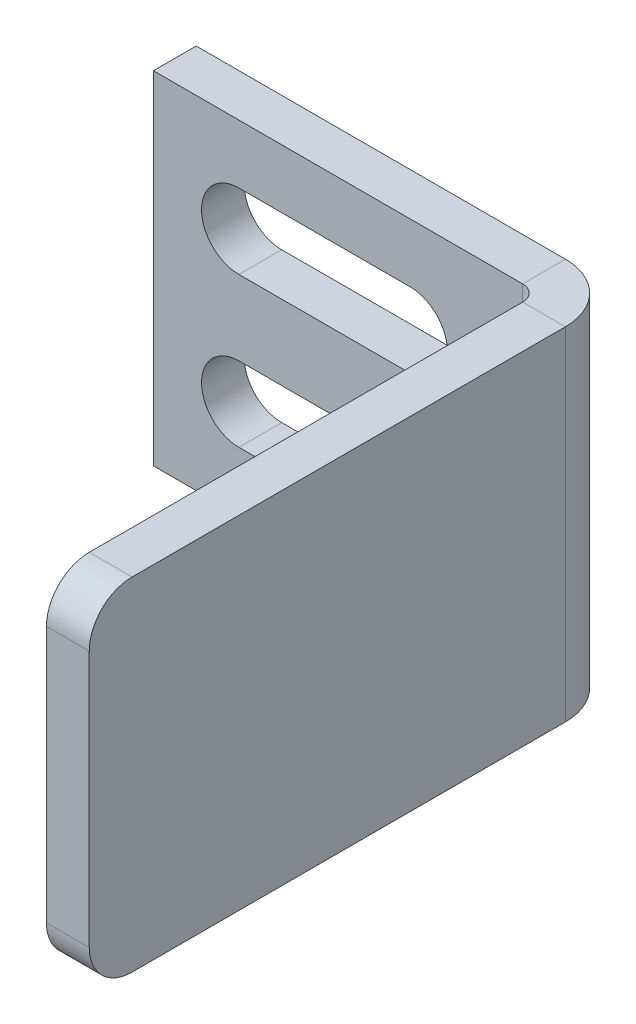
ISO-10303-21;
HEADER;
FILE_DESCRIPTION(('STEP AP214'),'2;1');
FILE_NAME('part.step','',(''),(''),'','','');
FILE_SCHEMA(('AUTOMOTIVE_DESIGN { 1 0 10303 214 1 1 1 1 }'));
ENDSEC;
DATA;
#1=APPLICATION_CONTEXT('core data for automotive mechanical design processes');
#2=APPLICATION_PROTOCOL_DEFINITION('international standard','automotive_design',2000,#1);
#3=PRODUCT_CONTEXT('',#1,'mechanical');
#4=PRODUCT('Part','Part','',(#3));
#5=PRODUCT_RELATED_PRODUCT_CATEGORY('part','',(#4));
#6=PRODUCT_DEFINITION_FORMATION('','',#4);
#7=PRODUCT_DEFINITION_CONTEXT('part definition',#1,'design');
#8=PRODUCT_DEFINITION('design','',#6,#7);
#9=PRODUCT_DEFINITION_SHAPE('','',#8);
#10=(LENGTH_UNIT() NAMED_UNIT(*) SI_UNIT(.MILLI.,.METRE.));
#11=(NAMED_UNIT(*) PLANE_ANGLE_UNIT() SI_UNIT($,.RADIAN.));
#12=(NAMED_UNIT(*) SI_UNIT($,.STERADIAN.) SOLID_ANGLE_UNIT());
#13=UNCERTAINTY_MEASURE_WITH_UNIT(LENGTH_MEASURE(1.E-05),#10,'distance_accuracy_value','');
#14=(GEOMETRIC_REPRESENTATION_CONTEXT(3) GLOBAL_UNCERTAINTY_ASSIGNED_CONTEXT((#13)) GLOBAL_UNIT_ASSIGNED_CONTEXT((#10,
#11,#12)) REPRESENTATION_CONTEXT('',''));
#15=CARTESIAN_POINT('',(0.,0.,0.));
#16=DIRECTION('',(0.,0.,1.));
#17=DIRECTION('',(1.,0.,0.));
#18=AXIS2_PLACEMENT_3D('',#15,#16,#17);
#19=CARTESIAN_POINT('',(4.23272528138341E-13,4.00724302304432,2.));
#20=DIRECTION('',(0.,-1.,0.));
#21=DIRECTION('',(1.,0.,0.));
#22=AXIS2_PLACEMENT_3D('',#19,#20,#21);
#23=PLANE('',#22);
#24=DIRECTION('',(0.,0.,-1.));
#25=VECTOR('',#24,1.);
#26=CARTESIAN_POINT('',(-2.73659999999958,4.00724302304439,2.));
#27=LINE('',#26,#25);
#28=CARTESIAN_POINT('',(-2.73659999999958,4.00724302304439,2.));
#29=VERTEX_POINT('',#28);
#30=CARTESIAN_POINT('',(-2.73659999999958,4.00724302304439,0.));
#31=VERTEX_POINT('',#30);
#32=EDGE_CURVE('E249',#29,#31,#27,.T.);
#33=ORIENTED_EDGE('',*,*,#32,.T.);
#34=DIRECTION('',(-1.,0.,0.));
#35=VECTOR('',#34,1.);
#36=CARTESIAN_POINT('',(4.23272528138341E-13,4.00724302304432,0.));
#37=LINE('',#36,#35);
#38=CARTESIAN_POINT('',(-19.9999999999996,4.00724302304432,0.));
#39=VERTEX_POINT('',#38);
#40=EDGE_CURVE('E262',#31,#39,#37,.T.);
#41=ORIENTED_EDGE('',*,*,#40,.T.);
#42=DIRECTION('',(0.,0.,-1.));
#43=VECTOR('',#42,1.);
#44=CARTESIAN_POINT('',(-19.9999999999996,4.00724302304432,2.));
#45=LINE('',#44,#43);
#46=CARTESIAN_POINT('',(-19.9999999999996,4.00724302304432,2.));
#47=VERTEX_POINT('',#46);
#48=EDGE_CURVE('E281',#47,#39,#45,.T.);
#49=ORIENTED_EDGE('',*,*,#48,.F.);
#50=DIRECTION('',(-1.,0.,0.));
#51=VECTOR('',#50,1.);
#52=CARTESIAN_POINT('',(4.23272528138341E-13,4.00724302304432,2.));
#53=LINE('',#52,#51);
#54=EDGE_CURVE('E265',#29,#47,#53,.T.);
#55=ORIENTED_EDGE('',*,*,#54,.F.);
#56=EDGE_LOOP('',(#33,#41,#49,#55));
#57=FACE_BOUND('',#56,.T.);
#58=ADVANCED_FACE('F16',(#57),#23,.F.);
#59=CARTESIAN_POINT('',(0.,-11.9927569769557,2.));
#60=DIRECTION('',(0.,1.,0.));
#61=DIRECTION('',(-1.,0.,0.));
#62=AXIS2_PLACEMENT_3D('',#59,#60,#61);
#63=PLANE('',#62);
#64=DIRECTION('',(0.,0.,-1.));
#65=VECTOR('',#64,1.);
#66=CARTESIAN_POINT('',(-2.7366,-11.9927569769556,2.));
#67=LINE('',#66,#65);
#68=CARTESIAN_POINT('',(-2.7366,-11.9927569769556,2.));
#69=VERTEX_POINT('',#68);
#70=CARTESIAN_POINT('',(-2.7366,-11.9927569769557,0.));
#71=VERTEX_POINT('',#70);
#72=EDGE_CURVE('E259',#69,#71,#67,.T.);
#73=ORIENTED_EDGE('',*,*,#72,.F.);
#74=DIRECTION('',(1.,0.,0.));
#75=VECTOR('',#74,1.);
#76=CARTESIAN_POINT('',(0.,-11.9927569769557,2.));
#77=LINE('',#76,#75);
#78=CARTESIAN_POINT('',(-19.9999999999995,-11.9927569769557,2.));
#79=VERTEX_POINT('',#78);
#80=EDGE_CURVE('E270',#79,#69,#77,.T.);
#81=ORIENTED_EDGE('',*,*,#80,.F.);
#82=DIRECTION('',(0.,0.,-1.));
#83=VECTOR('',#82,1.);
#84=CARTESIAN_POINT('',(-19.9999999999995,-11.9927569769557,2.));
#85=LINE('',#84,#83);
#86=CARTESIAN_POINT('',(-19.9999999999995,-11.9927569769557,0.));
#87=VERTEX_POINT('',#86);
#88=EDGE_CURVE('E273',#79,#87,#85,.T.);
#89=ORIENTED_EDGE('',*,*,#88,.T.);
#90=DIRECTION('',(1.,0.,0.));
#91=VECTOR('',#90,1.);
#92=CARTESIAN_POINT('',(0.,-11.9927569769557,0.));
#93=LINE('',#92,#91);
#94=EDGE_CURVE('E268',#87,#71,#93,.T.);
#95=ORIENTED_EDGE('',*,*,#94,.T.);
#96=EDGE_LOOP('',(#73,#81,#89,#95));
#97=FACE_BOUND('',#96,.T.);
#98=ADVANCED_FACE('F334',(#97),#63,.F.);
#99=CARTESIAN_POINT('',(0.,0.,2.));
#100=DIRECTION('',(0.,0.,-1.));
#101=DIRECTION('',(-1.,0.,0.));
#102=AXIS2_PLACEMENT_3D('',#99,#100,#101);
#103=PLANE('',#102);
#104=DIRECTION('',(1.,0.,0.));
#105=VECTOR('',#104,1.);
#106=CARTESIAN_POINT('',(-15.9999999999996,-2.24275697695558,2.));
#107=LINE('',#106,#105);
#108=CARTESIAN_POINT('',(-15.9999999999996,-2.24275697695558,2.));
#109=VERTEX_POINT('',#108);
#110=CARTESIAN_POINT('',(-7.99999999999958,-2.24275697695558,2.));
#111=VERTEX_POINT('',#110);
#112=EDGE_CURVE('E177',#109,#111,#107,.T.);
#113=ORIENTED_EDGE('',*,*,#112,.F.);
#114=CARTESIAN_POINT('',(-15.9999999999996,-0.492756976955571,2.));
#115=DIRECTION('',(0.,0.,1.));
#116=DIRECTION('',(-1.,0.,0.));
#117=AXIS2_PLACEMENT_3D('',#114,#115,#116);
#118=CIRCLE('',#117,1.75);
#119=CARTESIAN_POINT('',(-15.9999999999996,1.25724302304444,2.));
#120=VERTEX_POINT('',#119);
#121=EDGE_CURVE('E150',#120,#109,#118,.T.);
#122=ORIENTED_EDGE('',*,*,#121,.F.);
#123=DIRECTION('',(-1.,0.,0.));
#124=VECTOR('',#123,1.);
#125=CARTESIAN_POINT('',(-15.9999999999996,1.25724302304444,2.));
#126=LINE('',#125,#124);
#127=CARTESIAN_POINT('',(-7.99999999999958,1.25724302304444,2.));
#128=VERTEX_POINT('',#127);
#129=EDGE_CURVE('E168',#128,#120,#126,.T.);
#130=ORIENTED_EDGE('',*,*,#129,.F.);
#131=CARTESIAN_POINT('',(-7.99999999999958,-0.49275697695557,2.));
#132=DIRECTION('',(0.,0.,1.));
#133=DIRECTION('',(-1.,0.,0.));
#134=AXIS2_PLACEMENT_3D('',#131,#132,#133);
#135=CIRCLE('',#134,1.75);
#136=EDGE_CURVE('E171',#111,#128,#135,.T.);
#137=ORIENTED_EDGE('',*,*,#136,.F.);
#138=EDGE_LOOP('',(#113,#122,#130,#137));
#139=FACE_BOUND('',#138,.T.);
#140=DIRECTION('',(1.,0.,0.));
#141=VECTOR('',#140,1.);
#142=CARTESIAN_POINT('',(-15.9999999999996,-9.24275697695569,2.));
#143=LINE('',#142,#141);
#144=CARTESIAN_POINT('',(-15.9999999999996,-9.24275697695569,2.));
#145=VERTEX_POINT('',#144);
#146=CARTESIAN_POINT('',(-7.99999999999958,-9.24275697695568,2.));
#147=VERTEX_POINT('',#146);
#148=EDGE_CURVE('E202',#145,#147,#143,.T.);
#149=ORIENTED_EDGE('',*,*,#148,.F.);
#150=CARTESIAN_POINT('',(-15.9999999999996,-7.49275697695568,2.));
#151=DIRECTION('',(0.,0.,1.));
#152=DIRECTION('',(1.,0.,0.));
#153=AXIS2_PLACEMENT_3D('',#150,#151,#152);
#154=CIRCLE('',#153,1.75);
#155=CARTESIAN_POINT('',(-15.9999999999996,-5.74275697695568,2.));
#156=VERTEX_POINT('',#155);
#157=EDGE_CURVE('E183',#156,#145,#154,.T.);
#158=ORIENTED_EDGE('',*,*,#157,.F.);
#159=DIRECTION('',(-1.,0.,0.));
#160=VECTOR('',#159,1.);
#161=CARTESIAN_POINT('',(-15.9999999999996,-5.74275697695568,2.));
#162=LINE('',#161,#160);
#163=CARTESIAN_POINT('',(-7.99999999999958,-5.74275697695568,2.));
#164=VERTEX_POINT('',#163);
#165=EDGE_CURVE('E191',#164,#156,#162,.T.);
#166=ORIENTED_EDGE('',*,*,#165,.F.);
#167=CARTESIAN_POINT('',(-7.99999999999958,-7.49275697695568,2.));
#168=DIRECTION('',(0.,0.,1.));
#169=DIRECTION('',(1.,0.,0.));
#170=AXIS2_PLACEMENT_3D('',#167,#168,#169);
#171=CIRCLE('',#170,1.75);
#172=EDGE_CURVE('E205',#147,#164,#171,.T.);
#173=ORIENTED_EDGE('',*,*,#172,.F.);
#174=EDGE_LOOP('',(#149,#158,#166,#173));
#175=FACE_BOUND('',#174,.T.);
#176=DIRECTION('',(0.,1.,0.));
#177=VECTOR('',#176,1.);
#178=CARTESIAN_POINT('',(-2.73659999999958,4.00724302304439,2.));
#179=LINE('',#178,#177);
#180=EDGE_CURVE('E255',#29,#69,#179,.F.);
#181=ORIENTED_EDGE('',*,*,#180,.F.);
#182=ORIENTED_EDGE('',*,*,#54,.T.);
#183=DIRECTION('',(0.,-1.,0.));
#184=VECTOR('',#183,1.);
#185=CARTESIAN_POINT('',(-19.9999999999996,4.00724302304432,2.));
#186=LINE('',#185,#184);
#187=EDGE_CURVE('E267',#47,#79,#186,.T.);
#188=ORIENTED_EDGE('',*,*,#187,.T.);
#189=ORIENTED_EDGE('',*,*,#80,.T.);
#190=EDGE_LOOP('',(#181,#182,#188,#189));
#191=FACE_BOUND('',#190,.T.);
#192=ADVANCED_FACE('F346',(#139,#175,#191),#103,.F.);
#193=CARTESIAN_POINT('',(0.,0.,0.));
#194=DIRECTION('',(0.,0.,-1.));
#195=DIRECTION('',(-1.,0.,0.));
#196=AXIS2_PLACEMENT_3D('',#193,#194,#195);
#197=PLANE('',#196);
#198=CARTESIAN_POINT('',(-15.9999999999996,-0.492756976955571,0.));
#199=DIRECTION('',(0.,0.,1.));
#200=DIRECTION('',(-1.,0.,0.));
#201=AXIS2_PLACEMENT_3D('',#198,#199,#200);
#202=CIRCLE('',#201,1.75);
#203=CARTESIAN_POINT('',(-15.9999999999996,1.25724302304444,0.));
#204=VERTEX_POINT('',#203);
#205=CARTESIAN_POINT('',(-15.9999999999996,-2.24275697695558,0.));
#206=VERTEX_POINT('',#205);
#207=EDGE_CURVE('E147',#204,#206,#202,.T.);
#208=ORIENTED_EDGE('',*,*,#207,.T.);
#209=DIRECTION('',(1.,0.,0.));
#210=VECTOR('',#209,1.);
#211=CARTESIAN_POINT('',(-15.9999999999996,-2.24275697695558,0.));
#212=LINE('',#211,#210);
#213=CARTESIAN_POINT('',(-7.99999999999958,-2.24275697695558,0.));
#214=VERTEX_POINT('',#213);
#215=EDGE_CURVE('E159',#206,#214,#212,.T.);
#216=ORIENTED_EDGE('',*,*,#215,.T.);
#217=CARTESIAN_POINT('',(-7.99999999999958,-0.49275697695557,0.));
#218=DIRECTION('',(0.,0.,1.));
#219=DIRECTION('',(-1.,0.,0.));
#220=AXIS2_PLACEMENT_3D('',#217,#218,#219);
#221=CIRCLE('',#220,1.75);
#222=CARTESIAN_POINT('',(-7.99999999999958,1.25724302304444,0.));
#223=VERTEX_POINT('',#222);
#224=EDGE_CURVE('E163',#214,#223,#221,.T.);
#225=ORIENTED_EDGE('',*,*,#224,.T.);
#226=DIRECTION('',(-1.,0.,0.));
#227=VECTOR('',#226,1.);
#228=CARTESIAN_POINT('',(-15.9999999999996,1.25724302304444,0.));
#229=LINE('',#228,#227);
#230=EDGE_CURVE('E155',#223,#204,#229,.T.);
#231=ORIENTED_EDGE('',*,*,#230,.T.);
#232=EDGE_LOOP('',(#208,#216,#225,#231));
#233=FACE_BOUND('',#232,.T.);
#234=CARTESIAN_POINT('',(-15.9999999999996,-7.49275697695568,0.));
#235=DIRECTION('',(0.,0.,1.));
#236=DIRECTION('',(1.,0.,0.));
#237=AXIS2_PLACEMENT_3D('',#234,#235,#236);
#238=CIRCLE('',#237,1.75);
#239=CARTESIAN_POINT('',(-15.9999999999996,-5.74275697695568,0.));
#240=VERTEX_POINT('',#239);
#241=CARTESIAN_POINT('',(-15.9999999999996,-9.24275697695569,0.));
#242=VERTEX_POINT('',#241);
#243=EDGE_CURVE('E187',#240,#242,#238,.T.);
#244=ORIENTED_EDGE('',*,*,#243,.T.);
#245=DIRECTION('',(1.,0.,0.));
#246=VECTOR('',#245,1.);
#247=CARTESIAN_POINT('',(-15.9999999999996,-9.24275697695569,0.));
#248=LINE('',#247,#246);
#249=CARTESIAN_POINT('',(-7.99999999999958,-9.24275697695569,0.));
#250=VERTEX_POINT('',#249);
#251=EDGE_CURVE('E190',#242,#250,#248,.T.);
#252=ORIENTED_EDGE('',*,*,#251,.T.);
#253=CARTESIAN_POINT('',(-7.99999999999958,-7.49275697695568,0.));
#254=DIRECTION('',(0.,0.,1.));
#255=DIRECTION('',(1.,0.,0.));
#256=AXIS2_PLACEMENT_3D('',#253,#254,#255);
#257=CIRCLE('',#256,1.75);
#258=CARTESIAN_POINT('',(-7.99999999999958,-5.74275697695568,0.));
#259=VERTEX_POINT('',#258);
#260=EDGE_CURVE('E194',#250,#259,#257,.T.);
#261=ORIENTED_EDGE('',*,*,#260,.T.);
#262=DIRECTION('',(-1.,0.,0.));
#263=VECTOR('',#262,1.);
#264=CARTESIAN_POINT('',(-15.9999999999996,-5.74275697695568,0.));
#265=LINE('',#264,#263);
#266=EDGE_CURVE('E197',#259,#240,#265,.T.);
#267=ORIENTED_EDGE('',*,*,#266,.T.);
#268=EDGE_LOOP('',(#244,#252,#261,#267));
#269=FACE_BOUND('',#268,.T.);
#270=ORIENTED_EDGE('',*,*,#40,.F.);
#271=DIRECTION('',(0.,1.,0.));
#272=VECTOR('',#271,1.);
#273=CARTESIAN_POINT('',(-2.73659999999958,4.00724302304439,0.));
#274=LINE('',#273,#272);
#275=EDGE_CURVE('E242',#31,#71,#274,.F.);
#276=ORIENTED_EDGE('',*,*,#275,.T.);
#277=ORIENTED_EDGE('',*,*,#94,.F.);
#278=DIRECTION('',(0.,-1.,0.));
#279=VECTOR('',#278,1.);
#280=CARTESIAN_POINT('',(-19.9999999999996,4.00724302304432,0.));
#281=LINE('',#280,#279);
#282=EDGE_CURVE('E275',#39,#87,#281,.T.);
#283=ORIENTED_EDGE('',*,*,#282,.F.);
#284=EDGE_LOOP('',(#270,#276,#277,#283));
#285=FACE_BOUND('',#284,.T.);
#286=ADVANCED_FACE('F165',(#233,#269,#285),#197,.T.);
#287=CARTESIAN_POINT('',(-19.9999999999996,4.00724302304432,2.));
#288=DIRECTION('',(1.,0.,0.));
#289=DIRECTION('',(0.,1.,0.));
#290=AXIS2_PLACEMENT_3D('',#287,#288,#289);
#291=PLANE('',#290);
#292=ORIENTED_EDGE('',*,*,#282,.T.);
#293=ORIENTED_EDGE('',*,*,#88,.F.);
#294=ORIENTED_EDGE('',*,*,#187,.F.);
#295=ORIENTED_EDGE('',*,*,#48,.T.);
#296=EDGE_LOOP('',(#292,#293,#294,#295));
#297=FACE_BOUND('',#296,.T.);
#298=ADVANCED_FACE('F338',(#297),#291,.F.);
#299=CARTESIAN_POINT('',(-2.7366,-11.9927569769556,2.7366));
#300=DIRECTION('',(0.,-1.,0.));
#301=DIRECTION('',(1.,0.,0.));
#302=AXIS2_PLACEMENT_3D('',#299,#300,#301);
#303=PLANE('',#302);
#304=DIRECTION('',(-1.,0.,0.));
#305=VECTOR('',#304,1.);
#306=CARTESIAN_POINT('',(0.,-11.9927569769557,2.7366));
#307=LINE('',#306,#305);
#308=CARTESIAN_POINT('',(-2.,-11.9927569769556,2.7366));
#309=VERTEX_POINT('',#308);
#310=CARTESIAN_POINT('',(0.,-11.9927569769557,2.7366));
#311=VERTEX_POINT('',#310);
#312=EDGE_CURVE('E212',#309,#311,#307,.F.);
#313=ORIENTED_EDGE('',*,*,#312,.F.);
#314=CARTESIAN_POINT('',(-2.7366,-11.9927569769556,2.7366));
#315=DIRECTION('',(0.,1.,0.));
#316=DIRECTION('',(-1.,0.,0.));
#317=AXIS2_PLACEMENT_3D('',#314,#315,#316);
#318=CIRCLE('',#317,0.7366);
#319=EDGE_CURVE('E252',#69,#309,#318,.F.);
#320=ORIENTED_EDGE('',*,*,#319,.F.);
#321=ORIENTED_EDGE('',*,*,#72,.T.);
#322=CARTESIAN_POINT('',(-2.7366,-11.9927569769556,2.7366));
#323=DIRECTION('',(0.,1.,0.));
#324=DIRECTION('',(-1.,0.,0.));
#325=AXIS2_PLACEMENT_3D('',#322,#323,#324);
#326=CIRCLE('',#325,2.7366);
#327=EDGE_CURVE('E245',#71,#311,#326,.F.);
#328=ORIENTED_EDGE('',*,*,#327,.T.);
#329=EDGE_LOOP('',(#313,#320,#321,#328));
#330=FACE_BOUND('',#329,.T.);
#331=ADVANCED_FACE('F325',(#330),#303,.T.);
#332=CARTESIAN_POINT('',(-2.73659999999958,4.00724302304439,2.7366));
#333=DIRECTION('',(0.,-1.,0.));
#334=DIRECTION('',(1.,0.,0.));
#335=AXIS2_PLACEMENT_3D('',#332,#333,#334);
#336=PLANE('',#335);
#337=CARTESIAN_POINT('',(-2.73659999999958,4.00724302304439,2.7366));
#338=DIRECTION('',(0.,1.,0.));
#339=DIRECTION('',(-1.,0.,0.));
#340=AXIS2_PLACEMENT_3D('',#337,#338,#339);
#341=CIRCLE('',#340,0.7366);
#342=CARTESIAN_POINT('',(-1.99999999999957,4.00724302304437,2.7366));
#343=VERTEX_POINT('',#342);
#344=EDGE_CURVE('E221',#343,#29,#341,.T.);
#345=ORIENTED_EDGE('',*,*,#344,.F.);
#346=DIRECTION('',(-1.,0.,0.));
#347=VECTOR('',#346,1.);
#348=CARTESIAN_POINT('',(-1.99999999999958,4.00724302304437,2.7366));
#349=LINE('',#348,#347);
#350=CARTESIAN_POINT('',(4.26001033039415E-13,4.00724302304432,2.7366));
#351=VERTEX_POINT('',#350);
#352=EDGE_CURVE('E235',#343,#351,#349,.F.);
#353=ORIENTED_EDGE('',*,*,#352,.T.);
#354=CARTESIAN_POINT('',(-2.73659999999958,4.00724302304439,2.7366));
#355=DIRECTION('',(0.,1.,0.));
#356=DIRECTION('',(-1.,0.,0.));
#357=AXIS2_PLACEMENT_3D('',#354,#355,#356);
#358=CIRCLE('',#357,2.7366);
#359=EDGE_CURVE('E246',#351,#31,#358,.T.);
#360=ORIENTED_EDGE('',*,*,#359,.T.);
#361=ORIENTED_EDGE('',*,*,#32,.F.);
#362=EDGE_LOOP('',(#345,#353,#360,#361));
#363=FACE_BOUND('',#362,.T.);
#364=ADVANCED_FACE('F321',(#363),#336,.F.);
#365=CARTESIAN_POINT('',(-2.73659999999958,4.00724302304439,2.7366));
#366=DIRECTION('',(0.,1.,0.));
#367=DIRECTION('',(1.,0.,0.));
#368=AXIS2_PLACEMENT_3D('',#365,#366,#367);
#369=CYLINDRICAL_SURFACE('',#368,2.7366);
#370=ORIENTED_EDGE('',*,*,#275,.F.);
#371=ORIENTED_EDGE('',*,*,#359,.F.);
#372=DIRECTION('',(0.,1.,0.));
#373=VECTOR('',#372,1.);
#374=CARTESIAN_POINT('',(0.,-11.9927569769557,2.7366));
#375=LINE('',#374,#373);
#376=EDGE_CURVE('E232',#351,#311,#375,.F.);
#377=ORIENTED_EDGE('',*,*,#376,.T.);
#378=ORIENTED_EDGE('',*,*,#327,.F.);
#379=EDGE_LOOP('',(#370,#371,#377,#378));
#380=FACE_BOUND('',#379,.T.);
#381=ADVANCED_FACE('F323',(#380),#369,.T.);
#382=CARTESIAN_POINT('',(-2.73659999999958,4.00724302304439,2.7366));
#383=DIRECTION('',(0.,1.,0.));
#384=DIRECTION('',(1.,0.,0.));
#385=AXIS2_PLACEMENT_3D('',#382,#383,#384);
#386=CYLINDRICAL_SURFACE('',#385,0.7366);
#387=ORIENTED_EDGE('',*,*,#180,.T.);
#388=ORIENTED_EDGE('',*,*,#319,.T.);
#389=DIRECTION('',(0.,1.,0.));
#390=VECTOR('',#389,1.);
#391=CARTESIAN_POINT('',(-2.,-11.9927569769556,2.7366));
#392=LINE('',#391,#390);
#393=EDGE_CURVE('E238',#309,#343,#392,.T.);
#394=ORIENTED_EDGE('',*,*,#393,.T.);
#395=ORIENTED_EDGE('',*,*,#344,.T.);
#396=EDGE_LOOP('',(#387,#388,#394,#395));
#397=FACE_BOUND('',#396,.T.);
#398=ADVANCED_FACE('F344',(#397),#386,.F.);
#399=CARTESIAN_POINT('',(5.03503488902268E-13,4.00724302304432,25.));
#400=DIRECTION('',(0.,-1.,0.));
#401=DIRECTION('',(1.,0.,0.));
#402=AXIS2_PLACEMENT_3D('',#399,#400,#401);
#403=PLANE('',#402);
#404=DIRECTION('',(0.,0.,-1.));
#405=VECTOR('',#404,1.);
#406=CARTESIAN_POINT('',(-1.9999999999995,4.00724302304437,25.));
#407=LINE('',#406,#405);
#408=CARTESIAN_POINT('',(-1.99999999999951,4.00724302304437,23.));
#409=VERTEX_POINT('',#408);
#410=EDGE_CURVE('E230',#343,#409,#407,.F.);
#411=ORIENTED_EDGE('',*,*,#410,.T.);
#412=DIRECTION('',(-1.,0.,0.));
#413=VECTOR('',#412,1.);
#414=CARTESIAN_POINT('',(4.96520526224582E-13,4.00724302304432,23.));
#415=LINE('',#414,#413);
#416=CARTESIAN_POINT('',(4.96772250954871E-13,4.00724302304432,23.));
#417=VERTEX_POINT('',#416);
#418=EDGE_CURVE('E11',#409,#417,#415,.F.);
#419=ORIENTED_EDGE('',*,*,#418,.T.);
#420=DIRECTION('',(0.,0.,1.));
#421=VECTOR('',#420,1.);
#422=CARTESIAN_POINT('',(4.16468180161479E-13,4.00724302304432,0.));
#423=LINE('',#422,#421);
#424=EDGE_CURVE('E224',#351,#417,#423,.T.);
#425=ORIENTED_EDGE('',*,*,#424,.F.);
#426=ORIENTED_EDGE('',*,*,#352,.F.);
#427=EDGE_LOOP('',(#411,#419,#425,#426));
#428=FACE_BOUND('',#427,.T.);
#429=ADVANCED_FACE('F318',(#428),#403,.F.);
#430=CARTESIAN_POINT('',(0.,-11.9927569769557,2.));
#431=DIRECTION('',(0.,1.,0.));
#432=DIRECTION('',(-1.,0.,0.));
#433=AXIS2_PLACEMENT_3D('',#430,#431,#432);
#434=PLANE('',#433);
#435=DIRECTION('',(0.,0.,-1.));
#436=VECTOR('',#435,1.);
#437=CARTESIAN_POINT('',(0.,-11.9927569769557,0.));
#438=LINE('',#437,#436);
#439=CARTESIAN_POINT('',(0.,-11.9927569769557,23.));
#440=VERTEX_POINT('',#439);
#441=EDGE_CURVE('E219',#440,#311,#438,.T.);
#442=ORIENTED_EDGE('',*,*,#441,.F.);
#443=DIRECTION('',(-1.,0.,0.));
#444=VECTOR('',#443,1.);
#445=CARTESIAN_POINT('',(0.,-11.9927569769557,23.));
#446=LINE('',#445,#444);
#447=CARTESIAN_POINT('',(-1.99999999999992,-11.9927569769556,23.));
#448=VERTEX_POINT('',#447);
#449=EDGE_CURVE('E284',#440,#448,#446,.T.);
#450=ORIENTED_EDGE('',*,*,#449,.T.);
#451=DIRECTION('',(0.,0.,1.));
#452=VECTOR('',#451,1.);
#453=CARTESIAN_POINT('',(-2.,-11.9927569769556,2.));
#454=LINE('',#453,#452);
#455=EDGE_CURVE('E226',#448,#309,#454,.F.);
#456=ORIENTED_EDGE('',*,*,#455,.T.);
#457=ORIENTED_EDGE('',*,*,#312,.T.);
#458=EDGE_LOOP('',(#442,#450,#456,#457));
#459=FACE_BOUND('',#458,.T.);
#460=ADVANCED_FACE('F304',(#459),#434,.F.);
#461=CARTESIAN_POINT('',(3.10949183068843E-13,0.,0.));
#462=DIRECTION('',(-1.,0.,0.));
#463=DIRECTION('',(0.,-1.,0.));
#464=AXIS2_PLACEMENT_3D('',#461,#462,#463);
#465=PLANE('',#464);
#466=DIRECTION('',(0.,-1.,0.));
#467=VECTOR('',#466,1.);
#468=CARTESIAN_POINT('',(3.98236216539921E-13,0.,25.));
#469=LINE('',#468,#467);
#470=CARTESIAN_POINT('',(4.51091076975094E-13,2.00724302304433,25.));
#471=VERTEX_POINT('',#470);
#472=CARTESIAN_POINT('',(1.35106257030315E-13,-9.99275697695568,25.));
#473=VERTEX_POINT('',#472);
#474=EDGE_CURVE('E222',#471,#473,#469,.T.);
#475=ORIENTED_EDGE('',*,*,#474,.T.);
#476=CARTESIAN_POINT('',(1.28123294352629E-13,-9.99275697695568,23.));
#477=DIRECTION('',(-1.,0.,0.));
#478=DIRECTION('',(0.,-1.,0.));
#479=AXIS2_PLACEMENT_3D('',#476,#477,#478);
#480=CIRCLE('',#479,2.);
#481=EDGE_CURVE('E24',#473,#440,#480,.F.);
#482=ORIENTED_EDGE('',*,*,#481,.T.);
#483=ORIENTED_EDGE('',*,*,#441,.T.);
#484=ORIENTED_EDGE('',*,*,#376,.F.);
#485=ORIENTED_EDGE('',*,*,#424,.T.);
#486=CARTESIAN_POINT('',(4.44108114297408E-13,2.00724302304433,23.));
#487=DIRECTION('',(-1.,0.,0.));
#488=DIRECTION('',(0.,-1.,0.));
#489=AXIS2_PLACEMENT_3D('',#486,#487,#488);
#490=CIRCLE('',#489,2.);
#491=EDGE_CURVE('E295',#417,#471,#490,.F.);
#492=ORIENTED_EDGE('',*,*,#491,.T.);
#493=EDGE_LOOP('',(#475,#482,#483,#484,#485,#492));
#494=FACE_BOUND('',#493,.T.);
#495=ADVANCED_FACE('F299',(#494),#465,.F.);
#496=CARTESIAN_POINT('',(-1.99999999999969,0.,0.));
#497=DIRECTION('',(-1.,0.,0.));
#498=DIRECTION('',(0.,-1.,0.));
#499=AXIS2_PLACEMENT_3D('',#496,#497,#498);
#500=PLANE('',#499);
#501=ORIENTED_EDGE('',*,*,#455,.F.);
#502=CARTESIAN_POINT('',(-1.99999999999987,-9.99275697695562,23.));
#503=DIRECTION('',(-1.,0.,0.));
#504=DIRECTION('',(0.,-1.,0.));
#505=AXIS2_PLACEMENT_3D('',#502,#503,#504);
#506=CIRCLE('',#505,2.);
#507=CARTESIAN_POINT('',(-1.99999999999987,-9.99275697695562,25.));
#508=VERTEX_POINT('',#507);
#509=EDGE_CURVE('E289',#448,#508,#506,.T.);
#510=ORIENTED_EDGE('',*,*,#509,.T.);
#511=DIRECTION('',(0.,1.,0.));
#512=VECTOR('',#511,1.);
#513=CARTESIAN_POINT('',(-1.99999999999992,-11.9927569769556,25.));
#514=LINE('',#513,#512);
#515=CARTESIAN_POINT('',(-1.99999999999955,2.00724302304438,25.));
#516=VERTEX_POINT('',#515);
#517=EDGE_CURVE('E228',#516,#508,#514,.F.);
#518=ORIENTED_EDGE('',*,*,#517,.F.);
#519=CARTESIAN_POINT('',(-1.99999999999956,2.00724302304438,23.));
#520=DIRECTION('',(-1.,0.,0.));
#521=DIRECTION('',(0.,-1.,0.));
#522=AXIS2_PLACEMENT_3D('',#519,#520,#521);
#523=CIRCLE('',#522,2.);
#524=EDGE_CURVE('E287',#516,#409,#523,.T.);
#525=ORIENTED_EDGE('',*,*,#524,.T.);
#526=ORIENTED_EDGE('',*,*,#410,.F.);
#527=ORIENTED_EDGE('',*,*,#393,.F.);
#528=EDGE_LOOP('',(#501,#510,#518,#525,#526,#527));
#529=FACE_BOUND('',#528,.T.);
#530=ADVANCED_FACE('F310',(#529),#500,.T.);
#531=CARTESIAN_POINT('',(0.,-11.9927569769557,25.));
#532=DIRECTION('',(0.,0.,-1.));
#533=DIRECTION('',(-1.,0.,0.));
#534=AXIS2_PLACEMENT_3D('',#531,#532,#533);
#535=PLANE('',#534);
#536=ORIENTED_EDGE('',*,*,#517,.T.);
#537=DIRECTION('',(-1.,0.,0.));
#538=VECTOR('',#537,1.);
#539=CARTESIAN_POINT('',(1.35063501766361E-13,-9.99275697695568,25.));
#540=LINE('',#539,#538);
#541=EDGE_CURVE('E37',#508,#473,#540,.F.);
#542=ORIENTED_EDGE('',*,*,#541,.T.);
#543=ORIENTED_EDGE('',*,*,#474,.F.);
#544=DIRECTION('',(-1.,0.,0.));
#545=VECTOR('',#544,1.);
#546=CARTESIAN_POINT('',(4.5104832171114E-13,2.00724302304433,25.));
#547=LINE('',#546,#545);
#548=EDGE_CURVE('E291',#471,#516,#547,.T.);
#549=ORIENTED_EDGE('',*,*,#548,.T.);
#550=EDGE_LOOP('',(#536,#542,#543,#549));
#551=FACE_BOUND('',#550,.T.);
#552=ADVANCED_FACE('F312',(#551),#535,.F.);
#553=CARTESIAN_POINT('',(-15.9999999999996,-7.49275697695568,0.));
#554=DIRECTION('',(0.,0.,1.));
#555=DIRECTION('',(1.,0.,0.));
#556=AXIS2_PLACEMENT_3D('',#553,#554,#555);
#557=CYLINDRICAL_SURFACE('',#556,1.75);
#558=ORIENTED_EDGE('',*,*,#157,.T.);
#559=DIRECTION('',(0.,0.,1.));
#560=VECTOR('',#559,1.);
#561=CARTESIAN_POINT('',(-15.9999999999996,-9.24275697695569,0.));
#562=LINE('',#561,#560);
#563=EDGE_CURVE('E200',#242,#145,#562,.T.);
#564=ORIENTED_EDGE('',*,*,#563,.F.);
#565=ORIENTED_EDGE('',*,*,#243,.F.);
#566=DIRECTION('',(0.,0.,1.));
#567=VECTOR('',#566,1.);
#568=CARTESIAN_POINT('',(-15.9999999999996,-5.74275697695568,0.));
#569=LINE('',#568,#567);
#570=EDGE_CURVE('E210',#240,#156,#569,.T.);
#571=ORIENTED_EDGE('',*,*,#570,.T.);
#572=EDGE_LOOP('',(#558,#564,#565,#571));
#573=FACE_BOUND('',#572,.T.);
#574=ADVANCED_FACE('F390',(#573),#557,.F.);
#575=CARTESIAN_POINT('',(-15.9999999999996,-5.74275697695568,0.));
#576=DIRECTION('',(0.,1.,0.));
#577=DIRECTION('',(-1.,0.,0.));
#578=AXIS2_PLACEMENT_3D('',#575,#576,#577);
#579=PLANE('',#578);
#580=ORIENTED_EDGE('',*,*,#165,.T.);
#581=ORIENTED_EDGE('',*,*,#570,.F.);
#582=ORIENTED_EDGE('',*,*,#266,.F.);
#583=DIRECTION('',(0.,0.,1.));
#584=VECTOR('',#583,1.);
#585=CARTESIAN_POINT('',(-7.99999999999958,-5.74275697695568,0.));
#586=LINE('',#585,#584);
#587=EDGE_CURVE('E213',#259,#164,#586,.T.);
#588=ORIENTED_EDGE('',*,*,#587,.T.);
#589=EDGE_LOOP('',(#580,#581,#582,#588));
#590=FACE_BOUND('',#589,.T.);
#591=ADVANCED_FACE('F386',(#590),#579,.F.);
#592=CARTESIAN_POINT('',(-7.99999999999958,-7.49275697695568,0.));
#593=DIRECTION('',(0.,0.,1.));
#594=DIRECTION('',(1.,0.,0.));
#595=AXIS2_PLACEMENT_3D('',#592,#593,#594);
#596=CYLINDRICAL_SURFACE('',#595,1.75);
#597=ORIENTED_EDGE('',*,*,#172,.T.);
#598=ORIENTED_EDGE('',*,*,#587,.F.);
#599=ORIENTED_EDGE('',*,*,#260,.F.);
#600=DIRECTION('',(0.,0.,1.));
#601=VECTOR('',#600,1.);
#602=CARTESIAN_POINT('',(-7.99999999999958,-9.24275697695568,0.));
#603=LINE('',#602,#601);
#604=EDGE_CURVE('E215',#250,#147,#603,.T.);
#605=ORIENTED_EDGE('',*,*,#604,.T.);
#606=EDGE_LOOP('',(#597,#598,#599,#605));
#607=FACE_BOUND('',#606,.T.);
#608=ADVANCED_FACE('F389',(#607),#596,.F.);
#609=CARTESIAN_POINT('',(-15.9999999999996,-9.24275697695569,0.));
#610=DIRECTION('',(0.,-1.,0.));
#611=DIRECTION('',(1.,0.,0.));
#612=AXIS2_PLACEMENT_3D('',#609,#610,#611);
#613=PLANE('',#612);
#614=ORIENTED_EDGE('',*,*,#148,.T.);
#615=ORIENTED_EDGE('',*,*,#604,.F.);
#616=ORIENTED_EDGE('',*,*,#251,.F.);
#617=ORIENTED_EDGE('',*,*,#563,.T.);
#618=EDGE_LOOP('',(#614,#615,#616,#617));
#619=FACE_BOUND('',#618,.T.);
#620=ADVANCED_FACE('F385',(#619),#613,.F.);
#621=CARTESIAN_POINT('',(-15.9999999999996,-0.492756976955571,0.));
#622=DIRECTION('',(0.,0.,1.));
#623=DIRECTION('',(1.,0.,0.));
#624=AXIS2_PLACEMENT_3D('',#621,#622,#623);
#625=CYLINDRICAL_SURFACE('',#624,1.75);
#626=ORIENTED_EDGE('',*,*,#121,.T.);
#627=DIRECTION('',(0.,0.,1.));
#628=VECTOR('',#627,1.);
#629=CARTESIAN_POINT('',(-15.9999999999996,-2.24275697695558,0.));
#630=LINE('',#629,#628);
#631=EDGE_CURVE('E143',#206,#109,#630,.T.);
#632=ORIENTED_EDGE('',*,*,#631,.F.);
#633=ORIENTED_EDGE('',*,*,#207,.F.);
#634=DIRECTION('',(0.,0.,1.));
#635=VECTOR('',#634,1.);
#636=CARTESIAN_POINT('',(-15.9999999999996,1.25724302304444,0.));
#637=LINE('',#636,#635);
#638=EDGE_CURVE('E181',#204,#120,#637,.T.);
#639=ORIENTED_EDGE('',*,*,#638,.T.);
#640=EDGE_LOOP('',(#626,#632,#633,#639));
#641=FACE_BOUND('',#640,.T.);
#642=ADVANCED_FACE('F145',(#641),#625,.F.);
#643=CARTESIAN_POINT('',(-15.9999999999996,1.25724302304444,0.));
#644=DIRECTION('',(0.,1.,0.));
#645=DIRECTION('',(-1.,0.,0.));
#646=AXIS2_PLACEMENT_3D('',#643,#644,#645);
#647=PLANE('',#646);
#648=ORIENTED_EDGE('',*,*,#129,.T.);
#649=ORIENTED_EDGE('',*,*,#638,.F.);
#650=ORIENTED_EDGE('',*,*,#230,.F.);
#651=DIRECTION('',(0.,0.,1.));
#652=VECTOR('',#651,1.);
#653=CARTESIAN_POINT('',(-7.99999999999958,1.25724302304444,0.));
#654=LINE('',#653,#652);
#655=EDGE_CURVE('E184',#223,#128,#654,.T.);
#656=ORIENTED_EDGE('',*,*,#655,.T.);
#657=EDGE_LOOP('',(#648,#649,#650,#656));
#658=FACE_BOUND('',#657,.T.);
#659=ADVANCED_FACE('F378',(#658),#647,.F.);
#660=CARTESIAN_POINT('',(-7.99999999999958,-0.49275697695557,0.));
#661=DIRECTION('',(0.,0.,1.));
#662=DIRECTION('',(1.,0.,0.));
#663=AXIS2_PLACEMENT_3D('',#660,#661,#662);
#664=CYLINDRICAL_SURFACE('',#663,1.75);
#665=ORIENTED_EDGE('',*,*,#136,.T.);
#666=ORIENTED_EDGE('',*,*,#655,.F.);
#667=ORIENTED_EDGE('',*,*,#224,.F.);
#668=DIRECTION('',(0.,0.,1.));
#669=VECTOR('',#668,1.);
#670=CARTESIAN_POINT('',(-7.99999999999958,-2.24275697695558,0.));
#671=LINE('',#670,#669);
#672=EDGE_CURVE('E154',#214,#111,#671,.T.);
#673=ORIENTED_EDGE('',*,*,#672,.T.);
#674=EDGE_LOOP('',(#665,#666,#667,#673));
#675=FACE_BOUND('',#674,.T.);
#676=ADVANCED_FACE('F372',(#675),#664,.F.);
#677=CARTESIAN_POINT('',(-15.9999999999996,-2.24275697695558,0.));
#678=DIRECTION('',(0.,-1.,0.));
#679=DIRECTION('',(1.,0.,0.));
#680=AXIS2_PLACEMENT_3D('',#677,#678,#679);
#681=PLANE('',#680);
#682=ORIENTED_EDGE('',*,*,#112,.T.);
#683=ORIENTED_EDGE('',*,*,#672,.F.);
#684=ORIENTED_EDGE('',*,*,#215,.F.);
#685=ORIENTED_EDGE('',*,*,#631,.T.);
#686=EDGE_LOOP('',(#682,#683,#684,#685));
#687=FACE_BOUND('',#686,.T.);
#688=ADVANCED_FACE('F160',(#687),#681,.F.);
#689=CARTESIAN_POINT('',(1.2815364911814E-13,-9.99275697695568,23.));
#690=DIRECTION('',(-1.,0.,0.));
#691=DIRECTION('',(0.,-1.,0.));
#692=AXIS2_PLACEMENT_3D('',#689,#690,#691);
#693=CYLINDRICAL_SURFACE('',#692,2.);
#694=ORIENTED_EDGE('',*,*,#481,.F.);
#695=ORIENTED_EDGE('',*,*,#541,.F.);
#696=ORIENTED_EDGE('',*,*,#509,.F.);
#697=ORIENTED_EDGE('',*,*,#449,.F.);
#698=EDGE_LOOP('',(#694,#695,#696,#697));
#699=FACE_BOUND('',#698,.T.);
#700=ADVANCED_FACE('F307',(#699),#693,.T.);
#701=CARTESIAN_POINT('',(4.44065359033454E-13,2.00724302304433,23.));
#702=DIRECTION('',(-1.,0.,0.));
#703=DIRECTION('',(0.,-1.,0.));
#704=AXIS2_PLACEMENT_3D('',#701,#702,#703);
#705=CYLINDRICAL_SURFACE('',#704,2.);
#706=ORIENTED_EDGE('',*,*,#491,.F.);
#707=ORIENTED_EDGE('',*,*,#418,.F.);
#708=ORIENTED_EDGE('',*,*,#524,.F.);
#709=ORIENTED_EDGE('',*,*,#548,.F.);
#710=EDGE_LOOP('',(#706,#707,#708,#709));
#711=FACE_BOUND('',#710,.T.);
#712=ADVANCED_FACE('F18',(#711),#705,.T.);
#713=CLOSED_SHELL('',(#58,#98,#192,#286,#298,#331,#364,#381,#398,#429,#460,#495,#530,#552,#574,
#591,#608,#620,#642,#659,#676,#688,#700,#712));
#714=MANIFOLD_SOLID_BREP('B1',#713);
#715=ADVANCED_BREP_SHAPE_REPRESENTATION('',(#18,#714),#14);
#716=SHAPE_DEFINITION_REPRESENTATION(#9,#715);
ENDSEC;
END-ISO-10303-21;
